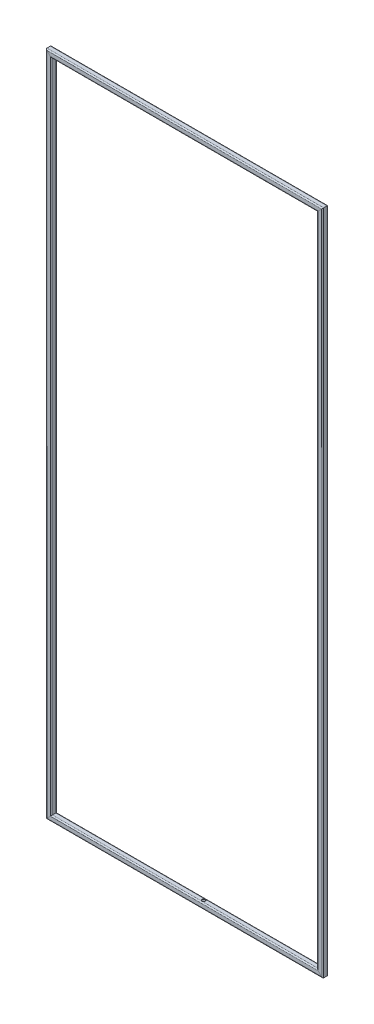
from build123d import *

# Parameters (mm, degrees)
TUBO_QUADRATO_20_X_20_X_2_0_1_DEPTH      = 2405.142135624
TUBO_QUADRATO_20_X_20_X_2_0_1_DEPTH_BACK = 15.142135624
TUBO_QUADRATO_20_X_20_X_2_0_1_2_DEPTH    = 1010.284271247
TUBO_QUADRATO_20_X_20_X_2_0_1_3_DEPTH    = 2420.284271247
TUBO_QUADRATO_20_X_20_X_2_0_1_4_DEPTH    = 1010.284271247
SCHIZZO2_R                               = 6
TAGLIO_ESTRUSIONE1_DEPTH                 = 5
SCHIZZO3_R                               = 6
TAGLIO_ESTRUSIONE2_DEPTH                 = 5


with BuildPart() as part:
    # Sketch1 → Tubo quadrato 20 X 20 X 2.0_1 (new, two sides: drawn at the far end of the back side and taken through both)
    with BuildSketch(Plane(origin=(-490, -1195, 0), x_dir=(-1, 0, 0), z_dir=(0, 1, 0)).offset(-TUBO_QUADRATO_20_X_20_X_2_0_1_DEPTH_BACK)):
        with BuildLine():
            Line((-6, -10), (6, -10))
            ThreePointArc((6, -10), (8.828427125, -8.828427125), (10, -6))
            Line((10, -6), (10, 6))
            ThreePointArc((10, 6), (8.828427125, 8.828427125), (6, 10))
            Line((6, 10), (-6, 10))
            ThreePointArc((-6, 10), (-8.828427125, 8.828427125), (-10, 6))
            Line((-10, 6), (-10, -6))
            ThreePointArc((-10, -6), (-8.828427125, -8.828427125), (-6, -10))
        make_face()
        with BuildLine():
            Line((-6, -8), (6, -8))
            ThreePointArc((6, -8), (7.414213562, -7.414213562), (8, -6))
            Line((8, -6), (8, 6))
            ThreePointArc((8, 6), (7.414213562, 7.414213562), (6, 8))
            Line((6, 8), (-6, 8))
            ThreePointArc((-6, 8), (-7.414213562, 7.414213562), (-8, 6))
            Line((-8, 6), (-8, -6))
            ThreePointArc((-8, -6), (-7.414213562, -7.414213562), (-6, -8))
        make_face(mode=Mode.SUBTRACT)
    extrude(amount=TUBO_QUADRATO_20_X_20_X_2_0_1_DEPTH + TUBO_QUADRATO_20_X_20_X_2_0_1_DEPTH_BACK)

    # Tubo quadrato 20 X 20 X 2.0_1 mitre 1
    split(bisect_by=Plane(origin=(-490, -1195, 0), x_dir=(-0.707106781, -0.707106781, 0), z_dir=(-0.707106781, 0.707106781, 0)), keep=Keep.TOP)

    # Tubo quadrato 20 X 20 X 2.0_1 mitre 2
    split(bisect_by=Plane(origin=(-490, 1195, 0), x_dir=(0.707106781, -0.707106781, 0), z_dir=(-0.707106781, -0.707106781, 0)), keep=Keep.TOP)


with BuildPart() as body_2:
    # Sketch1 on segment 2 (on carried to segment 2) → Tubo quadrato 20 X 20 X 2.0_1 2 (new body)
    with BuildSketch(Plane(origin=(-505.142135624, 1195, 0), x_dir=(0, 1, 0), z_dir=(1, 0, 0))):
        with BuildLine():
            Line((-6, -10), (6, -10))
            ThreePointArc((6, -10), (8.828427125, -8.828427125), (10, -6))
            Line((10, -6), (10, 6))
            ThreePointArc((10, 6), (8.828427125, 8.828427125), (6, 10))
            Line((6, 10), (-6, 10))
            ThreePointArc((-6, 10), (-8.828427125, 8.828427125), (-10, 6))
            Line((-10, 6), (-10, -6))
            ThreePointArc((-10, -6), (-8.828427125, -8.828427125), (-6, -10))
        make_face()
        with BuildLine():
            Line((-6, -8), (6, -8))
            ThreePointArc((6, -8), (7.414213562, -7.414213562), (8, -6))
            Line((8, -6), (8, 6))
            ThreePointArc((8, 6), (7.414213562, 7.414213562), (6, 8))
            Line((6, 8), (-6, 8))
            ThreePointArc((-6, 8), (-7.414213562, 7.414213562), (-8, 6))
            Line((-8, 6), (-8, -6))
            ThreePointArc((-8, -6), (-7.414213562, -7.414213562), (-6, -8))
        make_face(mode=Mode.SUBTRACT)
    extrude(amount=TUBO_QUADRATO_20_X_20_X_2_0_1_2_DEPTH)

    # Tubo quadrato 20 X 20 X 2.0_1 2 mitre 1
    split(bisect_by=Plane(origin=(490, 1195, 0), x_dir=(-0.707106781, -0.707106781, 0), z_dir=(-0.707106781, 0.707106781, 0)), keep=Keep.TOP)

    # Tubo quadrato 20 X 20 X 2.0_1 2 mitre 2
    split(bisect_by=Plane(origin=(-490, 1195, 0), x_dir=(-0.707106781, 0.707106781, 0), z_dir=(0.707106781, 0.707106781, 0)), keep=Keep.TOP)

    # Schizzo2 → Taglio-Estrusione1 (cut)
    with BuildSketch(Plane.XZ.offset(-1185)):
        with Locations(Location((-60, 0, 0), (0, 0, 270))):
            Circle(SCHIZZO2_R)
    extrude(amount=-TAGLIO_ESTRUSIONE1_DEPTH, mode=Mode.SUBTRACT)


with BuildPart() as body_3:
    # Sketch1 on segment 3 (on carried to segment 3) → Tubo quadrato 20 X 20 X 2.0_1 3 (new body)
    with BuildSketch(Plane(origin=(490, 1210.142135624, 0), x_dir=(1, 0, 0), z_dir=(0, -1, 0))):
        with BuildLine():
            Line((-6, -10), (6, -10))
            ThreePointArc((6, -10), (8.828427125, -8.828427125), (10, -6))
            Line((10, -6), (10, 6))
            ThreePointArc((10, 6), (8.828427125, 8.828427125), (6, 10))
            Line((6, 10), (-6, 10))
            ThreePointArc((-6, 10), (-8.828427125, 8.828427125), (-10, 6))
            Line((-10, 6), (-10, -6))
            ThreePointArc((-10, -6), (-8.828427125, -8.828427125), (-6, -10))
        make_face()
        with BuildLine():
            Line((-6, -8), (6, -8))
            ThreePointArc((6, -8), (7.414213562, -7.414213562), (8, -6))
            Line((8, -6), (8, 6))
            ThreePointArc((8, 6), (7.414213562, 7.414213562), (6, 8))
            Line((6, 8), (-6, 8))
            ThreePointArc((-6, 8), (-7.414213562, 7.414213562), (-8, 6))
            Line((-8, 6), (-8, -6))
            ThreePointArc((-8, -6), (-7.414213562, -7.414213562), (-6, -8))
        make_face(mode=Mode.SUBTRACT)
    extrude(amount=TUBO_QUADRATO_20_X_20_X_2_0_1_3_DEPTH)

    # Tubo quadrato 20 X 20 X 2.0_1 3 mitre 1
    split(bisect_by=Plane(origin=(490, -1195, 0), x_dir=(-0.707106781, 0.707106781, 0), z_dir=(0.707106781, 0.707106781, 0)), keep=Keep.TOP)

    # Tubo quadrato 20 X 20 X 2.0_1 3 mitre 2
    split(bisect_by=Plane(origin=(490, 1195, 0), x_dir=(0.707106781, 0.707106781, 0), z_dir=(0.707106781, -0.707106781, 0)), keep=Keep.TOP)


with BuildPart() as body_4:
    # Sketch1 on segment 4 (on carried to segment 4) → Tubo quadrato 20 X 20 X 2.0_1 4 (new body)
    with BuildSketch(Plane(origin=(505.142135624, -1195, 0), x_dir=(0, -1, 0), z_dir=(-1, 0, 0))):
        with BuildLine():
            Line((-6, -10), (6, -10))
            ThreePointArc((6, -10), (8.828427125, -8.828427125), (10, -6))
            Line((10, -6), (10, 6))
            ThreePointArc((10, 6), (8.828427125, 8.828427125), (6, 10))
            Line((6, 10), (-6, 10))
            ThreePointArc((-6, 10), (-8.828427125, 8.828427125), (-10, 6))
            Line((-10, 6), (-10, -6))
            ThreePointArc((-10, -6), (-8.828427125, -8.828427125), (-6, -10))
        make_face()
        with BuildLine():
            Line((-6, -8), (6, -8))
            ThreePointArc((6, -8), (7.414213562, -7.414213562), (8, -6))
            Line((8, -6), (8, 6))
            ThreePointArc((8, 6), (7.414213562, 7.414213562), (6, 8))
            Line((6, 8), (-6, 8))
            ThreePointArc((-6, 8), (-7.414213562, 7.414213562), (-8, 6))
            Line((-8, 6), (-8, -6))
            ThreePointArc((-8, -6), (-7.414213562, -7.414213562), (-6, -8))
        make_face(mode=Mode.SUBTRACT)
    extrude(amount=TUBO_QUADRATO_20_X_20_X_2_0_1_4_DEPTH)

    # Tubo quadrato 20 X 20 X 2.0_1 4 mitre 1
    split(bisect_by=Plane(origin=(490, -1195, 0), x_dir=(0.707106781, -0.707106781, 0), z_dir=(-0.707106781, -0.707106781, 0)), keep=Keep.TOP)

    # Tubo quadrato 20 X 20 X 2.0_1 4 mitre 2
    split(bisect_by=Plane(origin=(-490, -1195, 0), x_dir=(0.707106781, 0.707106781, 0), z_dir=(0.707106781, -0.707106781, 0)), keep=Keep.TOP)

    # Schizzo3 → Taglio-Estrusione2 (cut)
    with BuildSketch(Plane(origin=(0, -1185, 0), x_dir=(1, 0, 0), z_dir=(0, 1, 0))):
        with Locations(Location((60, 0, 0), (0, 0, 90))):
            Circle(SCHIZZO3_R)
    extrude(amount=-TAGLIO_ESTRUSIONE2_DEPTH, mode=Mode.SUBTRACT)


solid = Compound([part.part, body_2.part, body_3.part, body_4.part])
